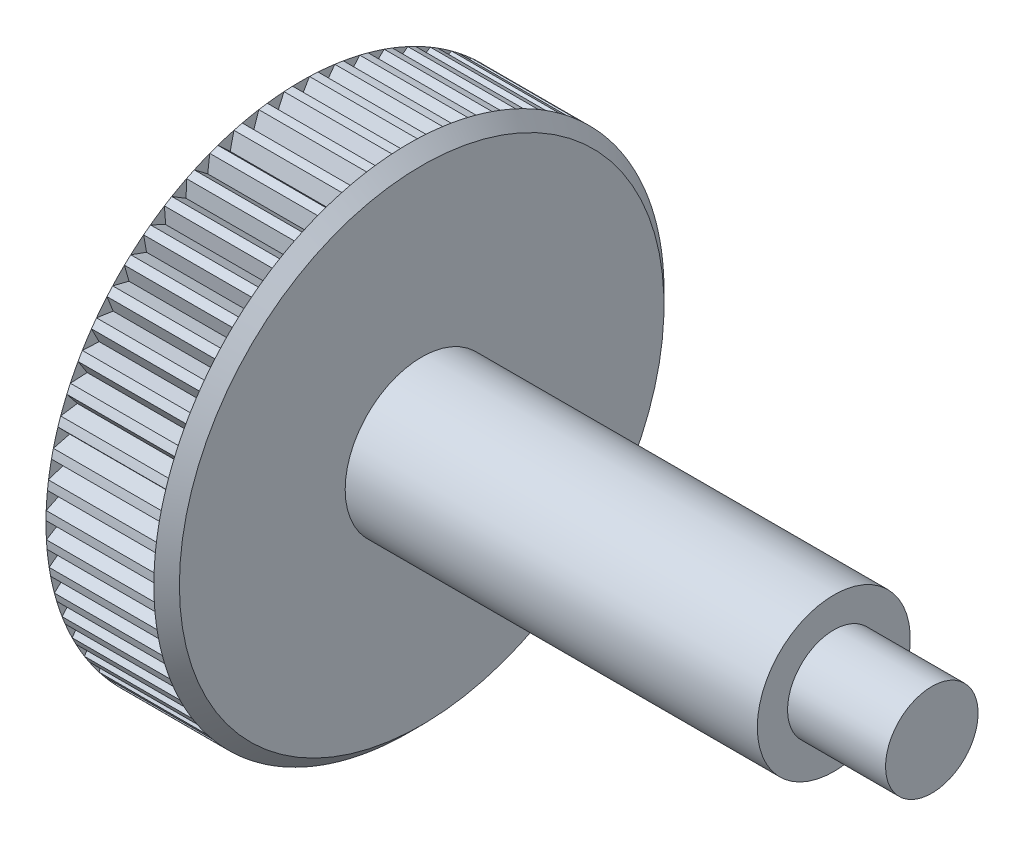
from build123d import *

# Parameters (mm, degrees)
CHAMFER1_SIZE           = 0.5
CUT_EXTRUDE1_DEPTH      = 4.229833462
CIRCULAR_PATTERN1_COUNT = 63


with BuildPart() as part:
    # Sketch1 → Base (revolve)
    with BuildSketch(Plane.XY, mode=Mode.PRIVATE) as base_sk:
        with BuildLine():
            Line((0, 0), (26, 0))
            Line((26, 0), (26, 1.814046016))
            Line((26, 1.814046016), (22.157688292, 1.814046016))
            Line((22.157688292, 1.814046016), (22.157688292, 3))
            Line((22.157688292, 3), (6, 3))
            Line((6, 3), (6, 10))
            Line((6, 10), (1.270166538, 10))
            ThreePointArc((1.270166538, 10), (0.318812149, 5.040171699), (0, 0))
        make_face()
    revolve(base_sk.sketch.rotate(Axis((-48.211075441, 0, 0), (1, 0, 0)), 90), axis=Axis((-48.211075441, 0, 0), (1, 0, 0)))

    # Chamfer1
    chamfer1_edges = [part.edges().sort_by_distance(p)[0] for p in [
        (6, 0, -10),
    ]]
    chamfer(chamfer1_edges, length=CHAMFER1_SIZE)

    # Sketch2 → Cut-Extrude1 (cut)
    with BuildSketch(Plane(origin=(1.270166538, 0, 0), x_dir=(0, 0, -1), z_dir=(1, 0, 0))):
        Polygon((0, 9.422649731), (0.5, 10.288675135), (-0.5, 10.288675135), align=None)
    cut_extrude1 = extrude(amount=CUT_EXTRUDE1_DEPTH, mode=Mode.SUBTRACT)

    # Circular-Pattern1: Cut-Extrude1 ×63 about axis
    circular_pattern1_axis = Axis((0, 0, 0), (1, 0, 0))
    for i in range(1, CIRCULAR_PATTERN1_COUNT):
        add(cut_extrude1.rotate(circular_pattern1_axis, i * 360 / CIRCULAR_PATTERN1_COUNT), mode=Mode.SUBTRACT)


solid = part.part
